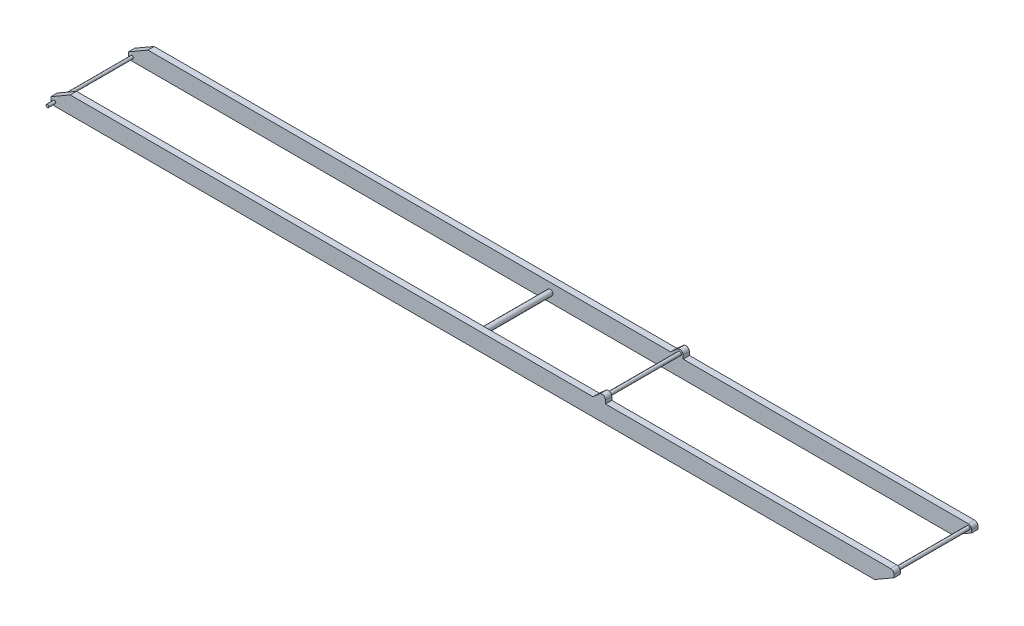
from build123d import *

# Parameters (mm, degrees)
ESQUISSE1_R             = 25
ESQUISSE1_R_2           = 20
EXTRUSION1_DEPTH        = 600
ESQUISSE2_W             = 12602.71456612
ESQUISSE2_H             = 1020
ENL_V_MAT_EXTRU_1_DEPTH = 12018.591272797
ESQUISSE3_R             = 20
EXTRUSION2_DEPTH        = 700
ESQUISSE4_R             = 25
EXTRUSION3_DEPTH        = 600
ESQUISSE5_R             = 40
EXTRUSION4_DEPTH        = 600
ESQUISSE6_R             = 25
EXTRUSION5_DEPTH        = 600
EXTRUSION6_DEPTH        = 90
EXTRUSION7_DEPTH        = 90


with BuildPart() as part:
    # Esquisse1 → Extrusion1 (new, symmetric)
    with BuildSketch(Plane.XY):
        with BuildLine():
            Line((50, 0), (50, -40))
            Line((50, -40), (-227.128129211, -200))
            Line((-227.128129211, -200), (-11950, -200))
            ThreePointArc((-11950, -200), (-11985.355339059, -185.355339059), (-12000, -150))
            Line((-12000, -150), (-12000, -110))
            Line((-12000, -110), (-11722.871870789, 50))
            Line((-11722.871870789, 50), (0, 50))
            ThreePointArc((0, 50), (35.355339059, 35.355339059), (50, 0))
        make_face()
        Circle(ESQUISSE1_R, mode=Mode.SUBTRACT)
        with Locations((-11949.05854032, -150)):
            Circle(ESQUISSE1_R_2, mode=Mode.SUBTRACT)
    extrude(amount=EXTRUSION1_DEPTH, both=True)

    # Esquisse2 → Enl_v. mat.-Extru.1 (cut, through all)
    with BuildSketch(Plane(origin=(0, 50, 0), x_dir=(1, 0, 0), z_dir=(0, 1, 0))):
        with Locations((-6089.360510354, 0)):
            Rectangle(ESQUISSE2_W, ESQUISSE2_H)
    extrude(amount=-ENL_V_MAT_EXTRU_1_DEPTH, mode=Mode.SUBTRACT)


with BuildPart() as enl_v_mat_extru_1_piece_1:
    # of the separate pieces the step leaves, piece 1, a body of its own (enl_v_mat_extru_1_pieces)
    add(part.part.solids().sort_by_distance((50, 0, -600))[0])



with BuildPart() as enl_v_mat_extru_1_piece_2:
    # of the separate pieces the step leaves, piece 2, a body of its own (enl_v_mat_extru_1_pieces)
    add(part.part.solids().sort_by_distance((50, 0, 510))[0])


with BuildPart() as enl_v_mat_extru_1_piece_1_1:
    add(enl_v_mat_extru_1_piece_1.part)

    add(enl_v_mat_extru_1_piece_2.part)  # Extrusion2 merges Enl_v. mat.-Extru.1 piece 2
    # Esquisse3 → Extrusion2 (add, symmetric)
    with BuildSketch(Plane.XY):
        with Locations(Location((-11949.05854032, -150, 0), (0, 0, 180))):
            Circle(ESQUISSE3_R)
    extrude(amount=EXTRUSION2_DEPTH, both=True)

    # Esquisse4 → Extrusion3 (add, symmetric)
    with BuildSketch(Plane.XY):
        with Locations(Location((0, 0, 0), (0, 0, 180))):
            Circle(ESQUISSE4_R)
    extrude(amount=EXTRUSION3_DEPTH, both=True)

    # Esquisse5 → Extrusion4 (add, symmetric)
    with BuildSketch(Plane.XY):
        with Locations(Location((-5974.52927016, -75, 0), (0, 0, 180))):
            Circle(ESQUISSE5_R)
    extrude(amount=EXTRUSION4_DEPTH, both=True)



with BuildPart() as body_2:
    # Esquisse6 → Extrusion5 (new, symmetric)
    with BuildSketch(Plane.XY):
        with Locations(Location((-4123.859357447, 97, 0), (0, 0, 180))):
            Circle(ESQUISSE6_R)
    extrude(amount=EXTRUSION5_DEPTH, both=True)


with BuildPart() as enl_v_mat_extru_1_piece_1_2:
    add(enl_v_mat_extru_1_piece_1_1.part)

    add(body_2.part)  # Extrusion6 merges body 2
    # Esquisse7 → Extrusion6 (add)
    with BuildSketch(Plane.XY.offset(600)):
        with BuildLine():
            Line((-4073.859357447, 97), (-4073.859357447, 47))
            Line((-4073.859357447, 47), (-4255.624013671, 47))
            Line((-4255.624013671, 47), (-4157.029520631, 134.413102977))
            ThreePointArc((-4157.029520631, 134.413102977), (-4103.347265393, 142.598838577), (-4073.859357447, 97))
        make_face()
    extrude(amount=-EXTRUSION6_DEPTH)

    # Esquisse8 → Extrusion7 (add)
    with BuildSketch(Plane(origin=(0, 0, -600), x_dir=(-1, 0, 0), z_dir=(0, 0, -1))):
        with BuildLine():
            Line((12000, -150), (12000, -110))
            Line((12000, -110), (11722.871870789, 50))
            Line((11722.871870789, 50), (4252.240270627, 50))
            Line((4252.240270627, 50), (4157.029520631, 134.413102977))
            ThreePointArc((4157.029520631, 134.413102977), (4103.347265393, 142.598838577), (4073.859357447, 97))
            Line((4073.859357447, 97), (4073.859357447, 50))
            Line((4073.859357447, 50), (0, 50))
            ThreePointArc((0, 50), (-35.355339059, 35.355339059), (-50, 0))
            Line((-50, 0), (-50, -40))
            Line((-50, -40), (227.128129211, -200))
            Line((227.128129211, -200), (11950, -200))
            ThreePointArc((11950, -200), (11985.355339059, -185.355339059), (12000, -150))
        make_face()
    extrude(amount=-EXTRUSION7_DEPTH)


solid = enl_v_mat_extru_1_piece_1_2.part
